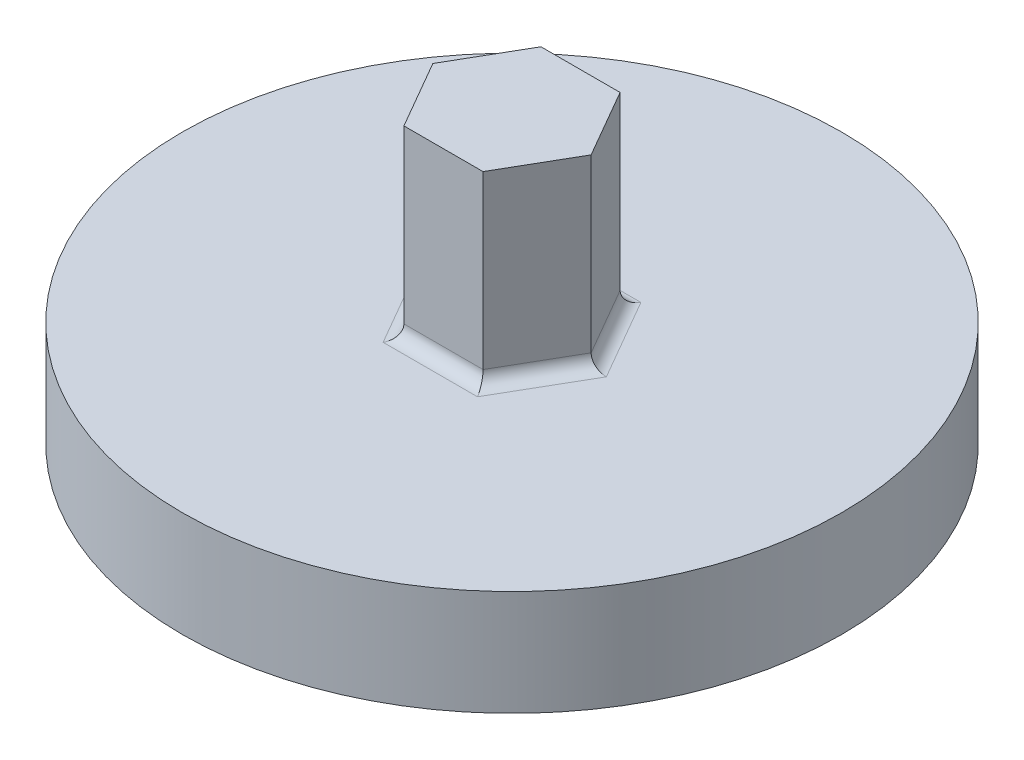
ISO-10303-21;
HEADER;
FILE_DESCRIPTION(('STEP AP214'),'2;1');
FILE_NAME('part.step','',(''),(''),'','','');
FILE_SCHEMA(('AUTOMOTIVE_DESIGN { 1 0 10303 214 1 1 1 1 }'));
ENDSEC;
DATA;
#1=APPLICATION_CONTEXT('core data for automotive mechanical design processes');
#2=APPLICATION_PROTOCOL_DEFINITION('international standard','automotive_design',2000,#1);
#3=PRODUCT_CONTEXT('',#1,'mechanical');
#4=PRODUCT('Part','Part','',(#3));
#5=PRODUCT_RELATED_PRODUCT_CATEGORY('part','',(#4));
#6=PRODUCT_DEFINITION_FORMATION('','',#4);
#7=PRODUCT_DEFINITION_CONTEXT('part definition',#1,'design');
#8=PRODUCT_DEFINITION('design','',#6,#7);
#9=PRODUCT_DEFINITION_SHAPE('','',#8);
#10=(LENGTH_UNIT() NAMED_UNIT(*) SI_UNIT(.MILLI.,.METRE.));
#11=(NAMED_UNIT(*) PLANE_ANGLE_UNIT() SI_UNIT($,.RADIAN.));
#12=(NAMED_UNIT(*) SI_UNIT($,.STERADIAN.) SOLID_ANGLE_UNIT());
#13=UNCERTAINTY_MEASURE_WITH_UNIT(LENGTH_MEASURE(1.E-05),#10,'distance_accuracy_value','');
#14=(GEOMETRIC_REPRESENTATION_CONTEXT(3) GLOBAL_UNCERTAINTY_ASSIGNED_CONTEXT((#13)) GLOBAL_UNIT_ASSIGNED_CONTEXT((#10,
#11,#12)) REPRESENTATION_CONTEXT('',''));
#15=CARTESIAN_POINT('',(0.,0.,0.));
#16=DIRECTION('',(0.,0.,1.));
#17=DIRECTION('',(1.,0.,0.));
#18=AXIS2_PLACEMENT_3D('',#15,#16,#17);
#19=CARTESIAN_POINT('',(0.,4.,0.));
#20=DIRECTION('',(0.,1.,0.));
#21=DIRECTION('',(0.,0.,1.));
#22=AXIS2_PLACEMENT_3D('',#19,#20,#21);
#23=PLANE('',#22);
#24=DIRECTION('',(-1.,0.,0.));
#25=VECTOR('',#24,1.);
#26=CARTESIAN_POINT('',(0.,4.,-3.09807621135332));
#27=LINE('',#26,#25);
#28=CARTESIAN_POINT('',(-1.78867513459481,4.,-3.09807621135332));
#29=VERTEX_POINT('',#28);
#30=CARTESIAN_POINT('',(1.78867513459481,4.,-3.09807621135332));
#31=VERTEX_POINT('',#30);
#32=EDGE_CURVE('E150',#29,#31,#27,.F.);
#33=ORIENTED_EDGE('',*,*,#32,.T.);
#34=DIRECTION('',(-0.5,0.,-0.866025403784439));
#35=VECTOR('',#34,1.);
#36=CARTESIAN_POINT('',(2.68301270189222,4.,-1.54903810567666));
#37=LINE('',#36,#35);
#38=CARTESIAN_POINT('',(3.57735026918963,4.,0.));
#39=VERTEX_POINT('',#38);
#40=EDGE_CURVE('E152',#31,#39,#37,.F.);
#41=ORIENTED_EDGE('',*,*,#40,.T.);
#42=DIRECTION('',(0.5,0.,-0.866025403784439));
#43=VECTOR('',#42,1.);
#44=CARTESIAN_POINT('',(2.68301270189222,4.,1.54903810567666));
#45=LINE('',#44,#43);
#46=CARTESIAN_POINT('',(1.78867513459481,4.,3.09807621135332));
#47=VERTEX_POINT('',#46);
#48=EDGE_CURVE('E144',#39,#47,#45,.F.);
#49=ORIENTED_EDGE('',*,*,#48,.T.);
#50=DIRECTION('',(1.,0.,0.));
#51=VECTOR('',#50,1.);
#52=CARTESIAN_POINT('',(0.,4.,3.09807621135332));
#53=LINE('',#52,#51);
#54=CARTESIAN_POINT('',(-1.78867513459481,4.,3.09807621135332));
#55=VERTEX_POINT('',#54);
#56=EDGE_CURVE('E142',#47,#55,#53,.F.);
#57=ORIENTED_EDGE('',*,*,#56,.T.);
#58=DIRECTION('',(0.5,0.,0.866025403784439));
#59=VECTOR('',#58,1.);
#60=CARTESIAN_POINT('',(-2.68301270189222,4.,1.54903810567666));
#61=LINE('',#60,#59);
#62=CARTESIAN_POINT('',(-3.57735026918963,4.,0.));
#63=VERTEX_POINT('',#62);
#64=EDGE_CURVE('E146',#55,#63,#61,.F.);
#65=ORIENTED_EDGE('',*,*,#64,.T.);
#66=DIRECTION('',(-0.5,0.,0.866025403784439));
#67=VECTOR('',#66,1.);
#68=CARTESIAN_POINT('',(-2.68301270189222,4.,-1.54903810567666));
#69=LINE('',#68,#67);
#70=EDGE_CURVE('E148',#63,#29,#69,.F.);
#71=ORIENTED_EDGE('',*,*,#70,.T.);
#72=EDGE_LOOP('',(#33,#41,#49,#57,#65,#71));
#73=FACE_BOUND('',#72,.T.);
#74=CARTESIAN_POINT('',(0.,4.,0.));
#75=DIRECTION('',(0.,1.,0.));
#76=DIRECTION('',(0.,0.,1.));
#77=AXIS2_PLACEMENT_3D('',#74,#75,#76);
#78=CIRCLE('',#77,12.5);
#79=CARTESIAN_POINT('',(0.,4.,12.5));
#80=VERTEX_POINT('',#79);
#81=EDGE_CURVE('E132',#80,#80,#78,.T.);
#82=ORIENTED_EDGE('',*,*,#81,.T.);
#83=EDGE_LOOP('',(#82));
#84=FACE_BOUND('',#83,.T.);
#85=ADVANCED_FACE('F33',(#73,#84),#23,.T.);
#86=CARTESIAN_POINT('',(0.,4.,0.));
#87=DIRECTION('',(0.,-1.,0.));
#88=DIRECTION('',(0.,0.,-1.));
#89=AXIS2_PLACEMENT_3D('',#86,#87,#88);
#90=CYLINDRICAL_SURFACE('',#89,12.5);
#91=ORIENTED_EDGE('',*,*,#81,.F.);
#92=EDGE_LOOP('',(#91));
#93=FACE_BOUND('',#92,.T.);
#94=CARTESIAN_POINT('',(0.,0.,0.));
#95=DIRECTION('',(0.,1.,0.));
#96=DIRECTION('',(0.,0.,1.));
#97=AXIS2_PLACEMENT_3D('',#94,#95,#96);
#98=CIRCLE('',#97,12.5);
#99=CARTESIAN_POINT('',(0.,0.,12.5));
#100=VERTEX_POINT('',#99);
#101=EDGE_CURVE('E129',#100,#100,#98,.T.);
#102=ORIENTED_EDGE('',*,*,#101,.T.);
#103=EDGE_LOOP('',(#102));
#104=FACE_BOUND('',#103,.T.);
#105=ADVANCED_FACE('F229',(#93,#104),#90,.T.);
#106=CARTESIAN_POINT('',(0.,0.,0.));
#107=DIRECTION('',(0.,1.,0.));
#108=DIRECTION('',(0.,0.,1.));
#109=AXIS2_PLACEMENT_3D('',#106,#107,#108);
#110=PLANE('',#109);
#111=ORIENTED_EDGE('',*,*,#101,.F.);
#112=EDGE_LOOP('',(#111));
#113=FACE_BOUND('',#112,.T.);
#114=ADVANCED_FACE('F234',(#113),#110,.F.);
#115=CARTESIAN_POINT('',(1.5,11.,2.59807621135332));
#116=DIRECTION('',(-0.866025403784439,0.,-0.5));
#117=DIRECTION('',(-0.5,0.,0.866025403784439));
#118=AXIS2_PLACEMENT_3D('',#115,#116,#117);
#119=PLANE('',#118);
#120=DIRECTION('',(0.,-1.,0.));
#121=VECTOR('',#120,1.);
#122=CARTESIAN_POINT('',(1.5,11.,2.59807621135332));
#123=LINE('',#122,#121);
#124=CARTESIAN_POINT('',(1.5,11.,2.59807621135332));
#125=VERTEX_POINT('',#124);
#126=CARTESIAN_POINT('',(1.5,4.5,2.59807621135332));
#127=VERTEX_POINT('',#126);
#128=EDGE_CURVE('E208',#125,#127,#123,.T.);
#129=ORIENTED_EDGE('',*,*,#128,.T.);
#130=DIRECTION('',(0.5,0.,-0.866025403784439));
#131=VECTOR('',#130,1.);
#132=CARTESIAN_POINT('',(1.5,4.5,2.59807621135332));
#133=LINE('',#132,#131);
#134=CARTESIAN_POINT('',(3.,4.5,0.));
#135=VERTEX_POINT('',#134);
#136=EDGE_CURVE('E42',#127,#135,#133,.T.);
#137=ORIENTED_EDGE('',*,*,#136,.T.);
#138=DIRECTION('',(0.,-1.,0.));
#139=VECTOR('',#138,1.);
#140=CARTESIAN_POINT('',(3.,11.,0.));
#141=LINE('',#140,#139);
#142=CARTESIAN_POINT('',(3.,11.,0.));
#143=VERTEX_POINT('',#142);
#144=EDGE_CURVE('E112',#143,#135,#141,.T.);
#145=ORIENTED_EDGE('',*,*,#144,.F.);
#146=DIRECTION('',(0.5,0.,-0.866025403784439));
#147=VECTOR('',#146,1.);
#148=CARTESIAN_POINT('',(1.5,11.,2.59807621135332));
#149=LINE('',#148,#147);
#150=EDGE_CURVE('E119',#125,#143,#149,.T.);
#151=ORIENTED_EDGE('',*,*,#150,.F.);
#152=EDGE_LOOP('',(#129,#137,#145,#151));
#153=FACE_BOUND('',#152,.T.);
#154=ADVANCED_FACE('F127',(#153),#119,.F.);
#155=CARTESIAN_POINT('',(3.,11.,0.));
#156=DIRECTION('',(-0.866025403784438,0.,0.5));
#157=DIRECTION('',(0.5,0.,0.866025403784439));
#158=AXIS2_PLACEMENT_3D('',#155,#156,#157);
#159=PLANE('',#158);
#160=ORIENTED_EDGE('',*,*,#144,.T.);
#161=DIRECTION('',(-0.5,0.,-0.866025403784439));
#162=VECTOR('',#161,1.);
#163=CARTESIAN_POINT('',(3.,4.5,0.));
#164=LINE('',#163,#162);
#165=CARTESIAN_POINT('',(1.5,4.5,-2.59807621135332));
#166=VERTEX_POINT('',#165);
#167=EDGE_CURVE('E139',#135,#166,#164,.T.);
#168=ORIENTED_EDGE('',*,*,#167,.T.);
#169=DIRECTION('',(0.,-1.,0.));
#170=VECTOR('',#169,1.);
#171=CARTESIAN_POINT('',(1.5,11.,-2.59807621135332));
#172=LINE('',#171,#170);
#173=CARTESIAN_POINT('',(1.5,11.,-2.59807621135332));
#174=VERTEX_POINT('',#173);
#175=EDGE_CURVE('E115',#174,#166,#172,.T.);
#176=ORIENTED_EDGE('',*,*,#175,.F.);
#177=DIRECTION('',(-0.5,0.,-0.866025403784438));
#178=VECTOR('',#177,1.);
#179=CARTESIAN_POINT('',(3.,11.,0.));
#180=LINE('',#179,#178);
#181=EDGE_CURVE('E107',#143,#174,#180,.T.);
#182=ORIENTED_EDGE('',*,*,#181,.F.);
#183=EDGE_LOOP('',(#160,#168,#176,#182));
#184=FACE_BOUND('',#183,.T.);
#185=ADVANCED_FACE('F109',(#184),#159,.F.);
#186=CARTESIAN_POINT('',(1.5,11.,-2.59807621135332));
#187=DIRECTION('',(0.,0.,1.));
#188=DIRECTION('',(1.,0.,0.));
#189=AXIS2_PLACEMENT_3D('',#186,#187,#188);
#190=PLANE('',#189);
#191=ORIENTED_EDGE('',*,*,#175,.T.);
#192=DIRECTION('',(-1.,0.,0.));
#193=VECTOR('',#192,1.);
#194=CARTESIAN_POINT('',(1.5,4.5,-2.59807621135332));
#195=LINE('',#194,#193);
#196=CARTESIAN_POINT('',(-1.5,4.5,-2.59807621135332));
#197=VERTEX_POINT('',#196);
#198=EDGE_CURVE('E155',#166,#197,#195,.T.);
#199=ORIENTED_EDGE('',*,*,#198,.T.);
#200=DIRECTION('',(0.,-1.,0.));
#201=VECTOR('',#200,1.);
#202=CARTESIAN_POINT('',(-1.5,11.,-2.59807621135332));
#203=LINE('',#202,#201);
#204=CARTESIAN_POINT('',(-1.5,11.,-2.59807621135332));
#205=VERTEX_POINT('',#204);
#206=EDGE_CURVE('E134',#205,#197,#203,.T.);
#207=ORIENTED_EDGE('',*,*,#206,.F.);
#208=DIRECTION('',(-1.,0.,0.));
#209=VECTOR('',#208,1.);
#210=CARTESIAN_POINT('',(1.5,11.,-2.59807621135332));
#211=LINE('',#210,#209);
#212=EDGE_CURVE('E118',#174,#205,#211,.T.);
#213=ORIENTED_EDGE('',*,*,#212,.F.);
#214=EDGE_LOOP('',(#191,#199,#207,#213));
#215=FACE_BOUND('',#214,.T.);
#216=ADVANCED_FACE('F197',(#215),#190,.F.);
#217=CARTESIAN_POINT('',(-1.5,11.,-2.59807621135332));
#218=DIRECTION('',(0.866025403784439,0.,0.5));
#219=DIRECTION('',(0.5,0.,-0.866025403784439));
#220=AXIS2_PLACEMENT_3D('',#217,#218,#219);
#221=PLANE('',#220);
#222=ORIENTED_EDGE('',*,*,#206,.T.);
#223=DIRECTION('',(-0.5,0.,0.866025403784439));
#224=VECTOR('',#223,1.);
#225=CARTESIAN_POINT('',(-1.5,4.5,-2.59807621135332));
#226=LINE('',#225,#224);
#227=CARTESIAN_POINT('',(-3.,4.5,0.));
#228=VERTEX_POINT('',#227);
#229=EDGE_CURVE('E157',#197,#228,#226,.T.);
#230=ORIENTED_EDGE('',*,*,#229,.T.);
#231=DIRECTION('',(0.,-1.,0.));
#232=VECTOR('',#231,1.);
#233=CARTESIAN_POINT('',(-3.,11.,0.));
#234=LINE('',#233,#232);
#235=CARTESIAN_POINT('',(-3.,11.,0.));
#236=VERTEX_POINT('',#235);
#237=EDGE_CURVE('E212',#236,#228,#234,.T.);
#238=ORIENTED_EDGE('',*,*,#237,.F.);
#239=DIRECTION('',(-0.5,0.,0.866025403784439));
#240=VECTOR('',#239,1.);
#241=CARTESIAN_POINT('',(-1.5,11.,-2.59807621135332));
#242=LINE('',#241,#240);
#243=EDGE_CURVE('E201',#205,#236,#242,.T.);
#244=ORIENTED_EDGE('',*,*,#243,.F.);
#245=EDGE_LOOP('',(#222,#230,#238,#244));
#246=FACE_BOUND('',#245,.T.);
#247=ADVANCED_FACE('F214',(#246),#221,.F.);
#248=CARTESIAN_POINT('',(-3.,11.,0.));
#249=DIRECTION('',(0.866025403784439,0.,-0.5));
#250=DIRECTION('',(-0.5,0.,-0.866025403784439));
#251=AXIS2_PLACEMENT_3D('',#248,#249,#250);
#252=PLANE('',#251);
#253=ORIENTED_EDGE('',*,*,#237,.T.);
#254=DIRECTION('',(0.5,0.,0.866025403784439));
#255=VECTOR('',#254,1.);
#256=CARTESIAN_POINT('',(-3.,4.5,0.));
#257=LINE('',#256,#255);
#258=CARTESIAN_POINT('',(-1.5,4.5,2.59807621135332));
#259=VERTEX_POINT('',#258);
#260=EDGE_CURVE('E56',#228,#259,#257,.T.);
#261=ORIENTED_EDGE('',*,*,#260,.T.);
#262=DIRECTION('',(0.,-1.,0.));
#263=VECTOR('',#262,1.);
#264=CARTESIAN_POINT('',(-1.5,11.,2.59807621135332));
#265=LINE('',#264,#263);
#266=CARTESIAN_POINT('',(-1.5,11.,2.59807621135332));
#267=VERTEX_POINT('',#266);
#268=EDGE_CURVE('E210',#267,#259,#265,.T.);
#269=ORIENTED_EDGE('',*,*,#268,.F.);
#270=DIRECTION('',(0.5,0.,0.866025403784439));
#271=VECTOR('',#270,1.);
#272=CARTESIAN_POINT('',(-3.,11.,0.));
#273=LINE('',#272,#271);
#274=EDGE_CURVE('E203',#236,#267,#273,.T.);
#275=ORIENTED_EDGE('',*,*,#274,.F.);
#276=EDGE_LOOP('',(#253,#261,#269,#275));
#277=FACE_BOUND('',#276,.T.);
#278=ADVANCED_FACE('F257',(#277),#252,.F.);
#279=CARTESIAN_POINT('',(-1.5,11.,2.59807621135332));
#280=DIRECTION('',(0.,0.,-1.));
#281=DIRECTION('',(-1.,0.,0.));
#282=AXIS2_PLACEMENT_3D('',#279,#280,#281);
#283=PLANE('',#282);
#284=ORIENTED_EDGE('',*,*,#268,.T.);
#285=DIRECTION('',(1.,0.,0.));
#286=VECTOR('',#285,1.);
#287=CARTESIAN_POINT('',(-1.5,4.5,2.59807621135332));
#288=LINE('',#287,#286);
#289=EDGE_CURVE('E11',#259,#127,#288,.T.);
#290=ORIENTED_EDGE('',*,*,#289,.T.);
#291=ORIENTED_EDGE('',*,*,#128,.F.);
#292=DIRECTION('',(1.,0.,0.));
#293=VECTOR('',#292,1.);
#294=CARTESIAN_POINT('',(-1.5,11.,2.59807621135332));
#295=LINE('',#294,#293);
#296=EDGE_CURVE('E124',#267,#125,#295,.T.);
#297=ORIENTED_EDGE('',*,*,#296,.F.);
#298=EDGE_LOOP('',(#284,#290,#291,#297));
#299=FACE_BOUND('',#298,.T.);
#300=ADVANCED_FACE('F260',(#299),#283,.F.);
#301=CARTESIAN_POINT('',(0.,11.,0.));
#302=DIRECTION('',(0.,1.,0.));
#303=DIRECTION('',(0.,0.,1.));
#304=AXIS2_PLACEMENT_3D('',#301,#302,#303);
#305=PLANE('',#304);
#306=ORIENTED_EDGE('',*,*,#150,.T.);
#307=ORIENTED_EDGE('',*,*,#181,.T.);
#308=ORIENTED_EDGE('',*,*,#212,.T.);
#309=ORIENTED_EDGE('',*,*,#243,.T.);
#310=ORIENTED_EDGE('',*,*,#274,.T.);
#311=ORIENTED_EDGE('',*,*,#296,.T.);
#312=EDGE_LOOP('',(#306,#307,#308,#309,#310,#311));
#313=FACE_BOUND('',#312,.T.);
#314=ADVANCED_FACE('F122',(#313),#305,.T.);
#315=CARTESIAN_POINT('',(-3.43301270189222,4.5,0.25));
#316=DIRECTION('',(0.5,0.,0.866025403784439));
#317=DIRECTION('',(0.866025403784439,0.,-0.5));
#318=AXIS2_PLACEMENT_3D('',#315,#316,#317);
#319=CYLINDRICAL_SURFACE('',#318,0.5);
#320=CARTESIAN_POINT('',(-3.57735026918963,4.5,0.));
#321=DIRECTION('',(0.,0.,1.));
#322=DIRECTION('',(1.,0.,0.));
#323=AXIS2_PLACEMENT_3D('',#320,#321,#322);
#324=ELLIPSE('',#323,0.577350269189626,0.5);
#325=EDGE_CURVE('E170',#63,#228,#324,.T.);
#326=ORIENTED_EDGE('',*,*,#325,.F.);
#327=ORIENTED_EDGE('',*,*,#64,.F.);
#328=CARTESIAN_POINT('',(-1.78867513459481,4.5,3.09807621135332));
#329=DIRECTION('',(0.866025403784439,0.,0.5));
#330=DIRECTION('',(0.5,0.,-0.866025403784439));
#331=AXIS2_PLACEMENT_3D('',#328,#329,#330);
#332=ELLIPSE('',#331,0.577350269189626,0.5);
#333=EDGE_CURVE('E37',#259,#55,#332,.F.);
#334=ORIENTED_EDGE('',*,*,#333,.F.);
#335=ORIENTED_EDGE('',*,*,#260,.F.);
#336=EDGE_LOOP('',(#326,#327,#334,#335));
#337=FACE_BOUND('',#336,.T.);
#338=ADVANCED_FACE('F35',(#337),#319,.F.);
#339=CARTESIAN_POINT('',(-1.5,4.5,3.09807621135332));
#340=DIRECTION('',(1.,0.,0.));
#341=DIRECTION('',(0.,0.,-1.));
#342=AXIS2_PLACEMENT_3D('',#339,#340,#341);
#343=CYLINDRICAL_SURFACE('',#342,0.5);
#344=ORIENTED_EDGE('',*,*,#333,.T.);
#345=ORIENTED_EDGE('',*,*,#56,.F.);
#346=CARTESIAN_POINT('',(1.78867513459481,4.5,3.09807621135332));
#347=DIRECTION('',(0.866025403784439,0.,-0.5));
#348=DIRECTION('',(0.5,0.,0.866025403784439));
#349=AXIS2_PLACEMENT_3D('',#346,#347,#348);
#350=ELLIPSE('',#349,0.577350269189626,0.5);
#351=EDGE_CURVE('E168',#127,#47,#350,.F.);
#352=ORIENTED_EDGE('',*,*,#351,.F.);
#353=ORIENTED_EDGE('',*,*,#289,.F.);
#354=EDGE_LOOP('',(#344,#345,#352,#353));
#355=FACE_BOUND('',#354,.T.);
#356=ADVANCED_FACE('F180',(#355),#343,.F.);
#357=CARTESIAN_POINT('',(-1.93301270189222,4.5,-2.84807621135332));
#358=DIRECTION('',(-0.5,0.,0.866025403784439));
#359=DIRECTION('',(0.866025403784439,0.,0.5));
#360=AXIS2_PLACEMENT_3D('',#357,#358,#359);
#361=CYLINDRICAL_SURFACE('',#360,0.5);
#362=ORIENTED_EDGE('',*,*,#325,.T.);
#363=ORIENTED_EDGE('',*,*,#229,.F.);
#364=CARTESIAN_POINT('',(-1.78867513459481,4.5,-3.09807621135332));
#365=DIRECTION('',(-0.866025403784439,0.,0.5));
#366=DIRECTION('',(0.5,0.,0.866025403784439));
#367=AXIS2_PLACEMENT_3D('',#364,#365,#366);
#368=ELLIPSE('',#367,0.577350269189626,0.5);
#369=EDGE_CURVE('E165',#29,#197,#368,.T.);
#370=ORIENTED_EDGE('',*,*,#369,.F.);
#371=ORIENTED_EDGE('',*,*,#70,.F.);
#372=EDGE_LOOP('',(#362,#363,#370,#371));
#373=FACE_BOUND('',#372,.T.);
#374=ADVANCED_FACE('F216',(#373),#361,.F.);
#375=CARTESIAN_POINT('',(1.93301270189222,4.5,2.84807621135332));
#376=DIRECTION('',(0.5,0.,-0.866025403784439));
#377=DIRECTION('',(-0.866025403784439,0.,-0.5));
#378=AXIS2_PLACEMENT_3D('',#375,#376,#377);
#379=CYLINDRICAL_SURFACE('',#378,0.5);
#380=ORIENTED_EDGE('',*,*,#351,.T.);
#381=ORIENTED_EDGE('',*,*,#48,.F.);
#382=CARTESIAN_POINT('',(3.57735026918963,4.5,0.));
#383=DIRECTION('',(0.,0.,-1.));
#384=DIRECTION('',(1.,0.,0.));
#385=AXIS2_PLACEMENT_3D('',#382,#383,#384);
#386=ELLIPSE('',#385,0.577350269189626,0.5);
#387=EDGE_CURVE('E163',#135,#39,#386,.F.);
#388=ORIENTED_EDGE('',*,*,#387,.F.);
#389=ORIENTED_EDGE('',*,*,#136,.F.);
#390=EDGE_LOOP('',(#380,#381,#388,#389));
#391=FACE_BOUND('',#390,.T.);
#392=ADVANCED_FACE('F190',(#391),#379,.F.);
#393=CARTESIAN_POINT('',(1.5,4.5,-3.09807621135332));
#394=DIRECTION('',(-1.,0.,0.));
#395=DIRECTION('',(0.,0.,1.));
#396=AXIS2_PLACEMENT_3D('',#393,#394,#395);
#397=CYLINDRICAL_SURFACE('',#396,0.5);
#398=ORIENTED_EDGE('',*,*,#369,.T.);
#399=ORIENTED_EDGE('',*,*,#198,.F.);
#400=CARTESIAN_POINT('',(1.78867513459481,4.5,-3.09807621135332));
#401=DIRECTION('',(-0.866025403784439,0.,-0.5));
#402=DIRECTION('',(-0.5,0.,0.866025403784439));
#403=AXIS2_PLACEMENT_3D('',#400,#401,#402);
#404=ELLIPSE('',#403,0.577350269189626,0.5);
#405=EDGE_CURVE('E161',#31,#166,#404,.T.);
#406=ORIENTED_EDGE('',*,*,#405,.F.);
#407=ORIENTED_EDGE('',*,*,#32,.F.);
#408=EDGE_LOOP('',(#398,#399,#406,#407));
#409=FACE_BOUND('',#408,.T.);
#410=ADVANCED_FACE('F219',(#409),#397,.F.);
#411=CARTESIAN_POINT('',(3.43301270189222,4.5,-0.250000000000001));
#412=DIRECTION('',(-0.5,0.,-0.866025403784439));
#413=DIRECTION('',(-0.866025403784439,0.,0.5));
#414=AXIS2_PLACEMENT_3D('',#411,#412,#413);
#415=CYLINDRICAL_SURFACE('',#414,0.5);
#416=ORIENTED_EDGE('',*,*,#387,.T.);
#417=ORIENTED_EDGE('',*,*,#40,.F.);
#418=ORIENTED_EDGE('',*,*,#405,.T.);
#419=ORIENTED_EDGE('',*,*,#167,.F.);
#420=EDGE_LOOP('',(#416,#417,#418,#419));
#421=FACE_BOUND('',#420,.T.);
#422=ADVANCED_FACE('F193',(#421),#415,.F.);
#423=CLOSED_SHELL('',(#85,#105,#114,#154,#185,#216,#247,#278,#300,#314,#338,#356,#374,#392,#410,#422));
#424=MANIFOLD_SOLID_BREP('B2',#423);
#425=ADVANCED_BREP_SHAPE_REPRESENTATION('',(#18,#424),#14);
#426=SHAPE_DEFINITION_REPRESENTATION(#9,#425);
ENDSEC;
END-ISO-10303-21;
